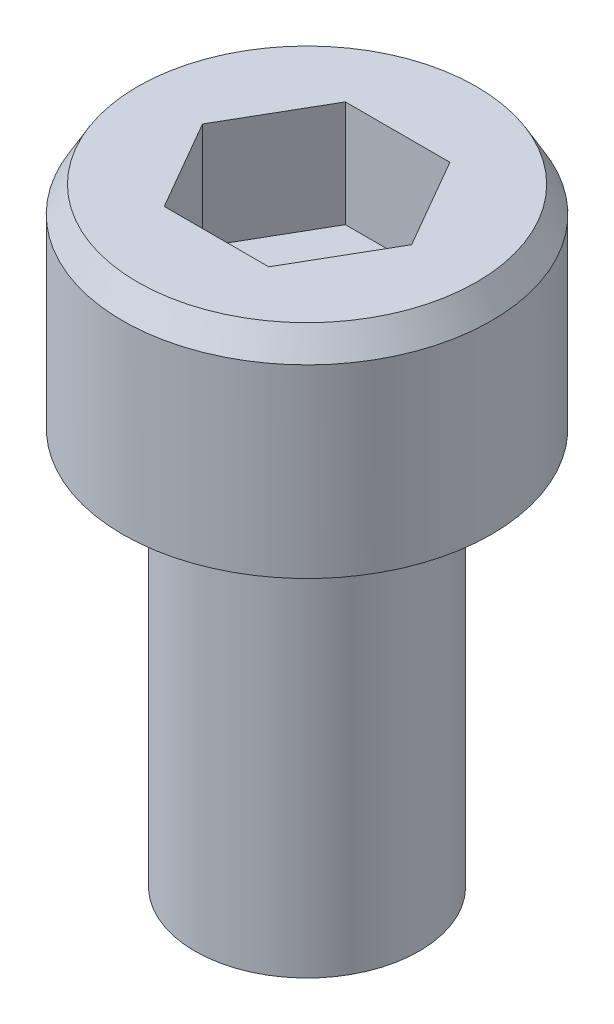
from build123d import *
from OCP.BRepFilletAPI import BRepFilletAPI_MakeChamfer

# Parameters (mm, degrees)
SKETCH1_R          = 1.7145
EXTRUDE1_DEPTH     = 6.0706
SKETCH2_R          = 2.8194
EXTRUDE2_DEPTH     = 3.4544
CHAMFER1_SIZE      = 0.396875
CHAMFER1_SIZE2     = 0.229135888
CUT_EXTRUDE1_DEPTH = 1.6256


with BuildPart() as part:
    # Sketch1 → Extrude1 (new body)
    with BuildSketch(Plane(origin=(0, 0, 0), x_dir=(1, 0, 0), z_dir=(0, 1, 0))):
        with Locations(Location((0, 0, 0), (0, 0, 270))):
            Circle(SKETCH1_R)
    extrude(amount=EXTRUDE1_DEPTH)

    # Sketch2 → Extrude2 (add)
    with BuildSketch(Plane(origin=(0, 6.0706, 0), x_dir=(-1, 0, 0), z_dir=(0, 1, 0))):
        with Locations(Location((0, 0, 0), (0, 0, 90))):
            Circle(SKETCH2_R)
    extrude(amount=EXTRUDE2_DEPTH)

    # Chamfer1: one chamfer whose edges measure the first distance from different faces: ONE call of the kernel's chamfer builder (chamfer() names one face for all edges)
    chamfer1_edges_1 = [part.edges().sort_by_distance(p)[0] for p in [
        (0, 0, -1.7145),
    ]]
    chamfer1_side_1 = [part.faces().sort_by_distance(p)[0] for p in [
        (0, 0, 0),
    ]]
    chamfer1_edges_2 = [part.edges().sort_by_distance(p)[0] for p in [
        (0, 6.0706, -2.8194),
    ]]
    chamfer1_side_2 = [part.faces().sort_by_distance(p)[0] for p in [
        (0, 6.0706, -2.739655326),
    ]]
    chamfer1_edges_3 = [part.edges().sort_by_distance(p)[0] for p in [
        (0, 9.525, -2.8194),
    ]]
    chamfer1_side_3 = [part.faces().sort_by_distance(p)[0] for p in [
        (0, 7.7978, -2.8194),
    ]]
    chamfer1 = BRepFilletAPI_MakeChamfer(part.part.solid().wrapped)
    for e in chamfer1_edges_1:
        chamfer1.Add(CHAMFER1_SIZE, CHAMFER1_SIZE2, e.wrapped, chamfer1_side_1[0].wrapped)  # the first distance lies on this face
    for e in chamfer1_edges_2:
        chamfer1.Add(CHAMFER1_SIZE, CHAMFER1_SIZE2, e.wrapped, chamfer1_side_2[0].wrapped)  # the first distance lies on this face
    for e in chamfer1_edges_3:
        chamfer1.Add(CHAMFER1_SIZE, CHAMFER1_SIZE2, e.wrapped, chamfer1_side_3[0].wrapped)  # the first distance lies on this face
    add(Compound.cast(chamfer1.Shape()), mode=Mode.REPLACE)

    # Sketch3 → Cut-Extrude1 (cut)
    with BuildSketch(Plane(origin=(0, 9.525, 0), x_dir=(-1, 0, 0), z_dir=(0, 1, 0))):
        Polygon((1.598451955, 0), (0.799225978, -1.3843), (-0.799225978, -1.3843), (-1.598451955, 0), (-0.799225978, 1.3843), (0.799225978, 1.3843), align=None)
    extrude(amount=-CUT_EXTRUDE1_DEPTH, mode=Mode.SUBTRACT)


solid = part.part
